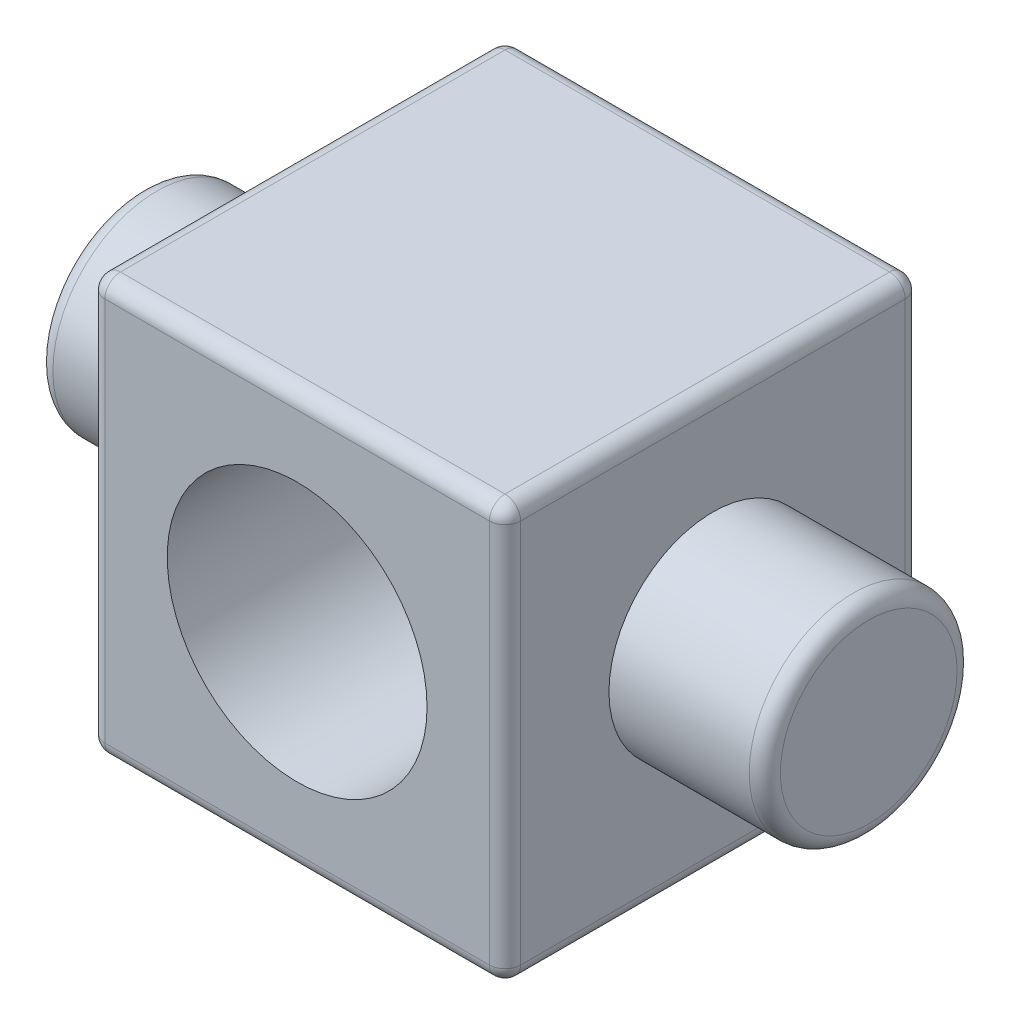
from build123d import *

# Parameters (mm, degrees)
ESQUISSE1_W        = 80
ESQUISSE1_H        = 80
ESQUISSE1_R        = 25
BOSS_EXTRU_1_DEPTH = 80
ESQUISSE2_R        = 20
BOSS_EXTRU_2_DEPTH = 30
BOSS_EXTRU_3_START = 30
ESQUISSE3_R        = 20
BOSS_EXTRU_3_DEPTH = 30
CONG_1_R           = 3


with BuildPart() as part:
    # Esquisse1 → Boss.-Extru.1 (new body)
    with BuildSketch(Plane.XY):
        with Locations((40, 40)):
            Rectangle(ESQUISSE1_W, ESQUISSE1_H)
        with Locations((40, 40)):
            Circle(ESQUISSE1_R, mode=Mode.SUBTRACT)
    extrude(amount=BOSS_EXTRU_1_DEPTH)

    # Esquisse2 → Boss.-Extru.2 (add)
    with BuildSketch(Plane(origin=(80, 0, 0), x_dir=(0, 0, -1), z_dir=(1, 0, 0))):
        with Locations(Location((-40, 40, 0), (0, 0, 180))):
            Circle(ESQUISSE2_R)
    extrude(amount=BOSS_EXTRU_2_DEPTH)

    # Esquisse3 → Boss.-Extru.3 (add)
    with BuildSketch(Plane.ZY.offset(BOSS_EXTRU_3_START)):
        with Locations((40, 40)):
            Circle(ESQUISSE3_R)
    extrude(amount=-BOSS_EXTRU_3_DEPTH)

    # Cong_1
    cong_1_edges = [part.edges().sort_by_distance(p)[0] for p in [
        (80, 40, 80),
        (40, 80, 80),
        (110, 40, 20),
        (-30, 40, 20),
        (0, 40, 80),
        (40, 80, 0),
        (80, 40, 0),
        (40, 0, 0),
        (0, 40, 0),
        (40, 0, 80),
        (0, 80, 40),
        (80, 80, 40),
        (80, 0, 40),
        (0, 0, 40),
    ]]
    fillet(cong_1_edges, radius=CONG_1_R)


solid = part.part
